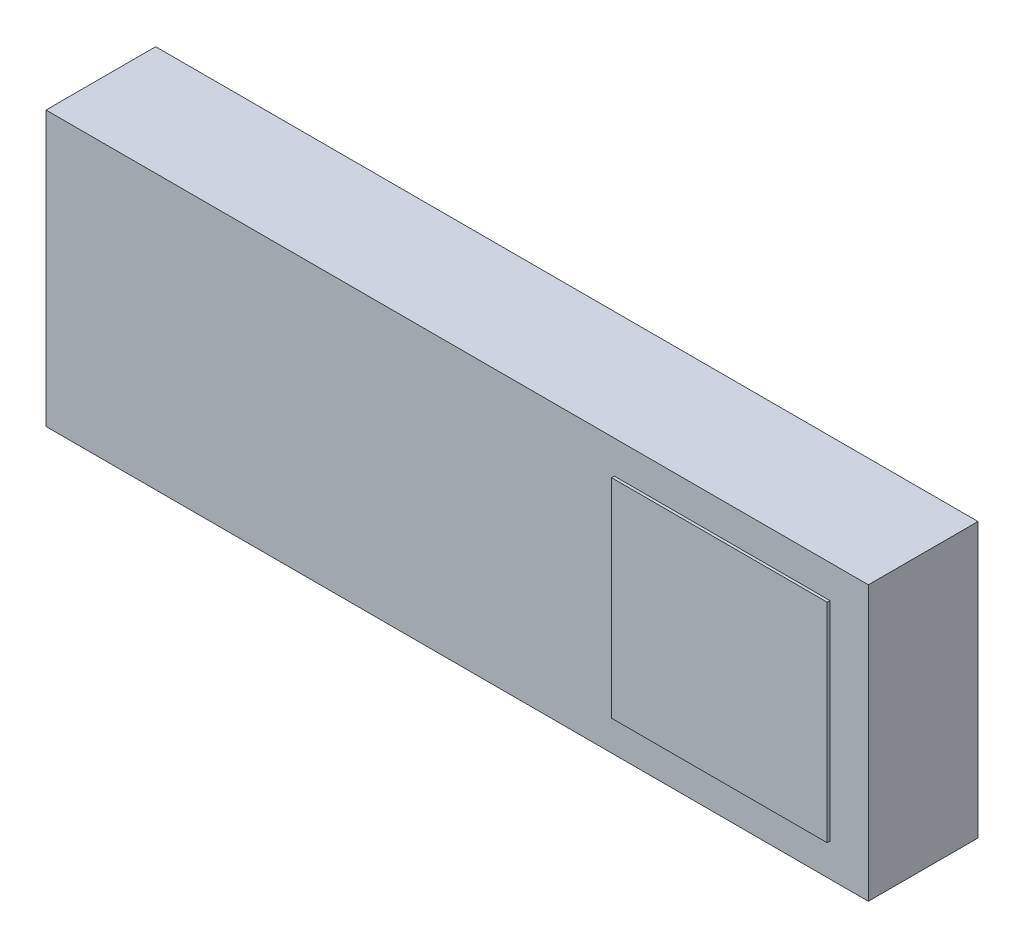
ISO-10303-21;
HEADER;
FILE_DESCRIPTION(('STEP AP214'),'2;1');
FILE_NAME('part.step','',(''),(''),'','','');
FILE_SCHEMA(('AUTOMOTIVE_DESIGN { 1 0 10303 214 1 1 1 1 }'));
ENDSEC;
DATA;
#1=APPLICATION_CONTEXT('core data for automotive mechanical design processes');
#2=APPLICATION_PROTOCOL_DEFINITION('international standard','automotive_design',2000,#1);
#3=PRODUCT_CONTEXT('',#1,'mechanical');
#4=PRODUCT('Part','Part','',(#3));
#5=PRODUCT_RELATED_PRODUCT_CATEGORY('part','',(#4));
#6=PRODUCT_DEFINITION_FORMATION('','',#4);
#7=PRODUCT_DEFINITION_CONTEXT('part definition',#1,'design');
#8=PRODUCT_DEFINITION('design','',#6,#7);
#9=PRODUCT_DEFINITION_SHAPE('','',#8);
#10=(LENGTH_UNIT() NAMED_UNIT(*) SI_UNIT(.MILLI.,.METRE.));
#11=(NAMED_UNIT(*) PLANE_ANGLE_UNIT() SI_UNIT($,.RADIAN.));
#12=(NAMED_UNIT(*) SI_UNIT($,.STERADIAN.) SOLID_ANGLE_UNIT());
#13=UNCERTAINTY_MEASURE_WITH_UNIT(LENGTH_MEASURE(1.E-05),#10,'distance_accuracy_value','');
#14=(GEOMETRIC_REPRESENTATION_CONTEXT(3) GLOBAL_UNCERTAINTY_ASSIGNED_CONTEXT((#13)) GLOBAL_UNIT_ASSIGNED_CONTEXT((#10,
#11,#12)) REPRESENTATION_CONTEXT('',''));
#15=CARTESIAN_POINT('',(0.,0.,0.));
#16=DIRECTION('',(0.,0.,1.));
#17=DIRECTION('',(1.,0.,0.));
#18=AXIS2_PLACEMENT_3D('',#15,#16,#17);
#19=CARTESIAN_POINT('',(-15.73850234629,-0.342490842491,0.41));
#20=DIRECTION('',(0.,0.,1.));
#21=DIRECTION('',(1.,0.,0.));
#22=AXIS2_PLACEMENT_3D('',#19,#20,#21);
#23=PLANE('',#22);
#24=DIRECTION('',(0.,1.,0.));
#25=VECTOR('',#24,1.);
#26=CARTESIAN_POINT('',(-16.13181907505,-0.722474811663,0.41));
#27=LINE('',#26,#25);
#28=CARTESIAN_POINT('',(-16.13181907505,-0.722474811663,0.41));
#29=VERTEX_POINT('',#28);
#30=CARTESIAN_POINT('',(-16.13181907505,0.03749312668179,0.41));
#31=VERTEX_POINT('',#30);
#32=EDGE_CURVE('E95',#29,#31,#27,.T.);
#33=ORIENTED_EDGE('',*,*,#32,.F.);
#34=DIRECTION('',(1.,0.,0.));
#35=VECTOR('',#34,1.);
#36=CARTESIAN_POINT('',(-15.34518561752,-0.722474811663,0.41));
#37=LINE('',#36,#35);
#38=CARTESIAN_POINT('',(-15.34518561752,-0.722474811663,0.41));
#39=VERTEX_POINT('',#38);
#40=EDGE_CURVE('E79',#39,#29,#37,.F.);
#41=ORIENTED_EDGE('',*,*,#40,.F.);
#42=DIRECTION('',(0.,1.,0.));
#43=VECTOR('',#42,1.);
#44=CARTESIAN_POINT('',(-15.34518561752,0.03749312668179,0.41));
#45=LINE('',#44,#43);
#46=CARTESIAN_POINT('',(-15.34518561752,0.03749312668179,0.41));
#47=VERTEX_POINT('',#46);
#48=EDGE_CURVE('E20',#47,#39,#45,.F.);
#49=ORIENTED_EDGE('',*,*,#48,.F.);
#50=DIRECTION('',(1.,0.,0.));
#51=VECTOR('',#50,1.);
#52=CARTESIAN_POINT('',(-16.13181907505,0.03749312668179,0.41));
#53=LINE('',#52,#51);
#54=EDGE_CURVE('E102',#31,#47,#53,.T.);
#55=ORIENTED_EDGE('',*,*,#54,.F.);
#56=EDGE_LOOP('',(#33,#41,#49,#55));
#57=FACE_BOUND('',#56,.T.);
#58=ADVANCED_FACE('F17',(#57),#23,.T.);
#59=CARTESIAN_POINT('',(-15.34518561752,0.03749312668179,0.4));
#60=DIRECTION('',(1.,0.,0.));
#61=DIRECTION('',(0.,0.,-1.));
#62=AXIS2_PLACEMENT_3D('',#59,#60,#61);
#63=PLANE('',#62);
#64=DIRECTION('',(0.,1.,0.));
#65=VECTOR('',#64,1.);
#66=CARTESIAN_POINT('',(-15.34518561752,-0.342490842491,0.4));
#67=LINE('',#66,#65);
#68=CARTESIAN_POINT('',(-15.34518561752,0.03749312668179,0.4));
#69=VERTEX_POINT('',#68);
#70=CARTESIAN_POINT('',(-15.34518561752,-0.722474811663,0.4));
#71=VERTEX_POINT('',#70);
#72=EDGE_CURVE('E108',#69,#71,#67,.F.);
#73=ORIENTED_EDGE('',*,*,#72,.F.);
#74=DIRECTION('',(0.,0.,1.));
#75=VECTOR('',#74,1.);
#76=CARTESIAN_POINT('',(-15.34518561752,0.03749312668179,0.4));
#77=LINE('',#76,#75);
#78=EDGE_CURVE('E90',#47,#69,#77,.F.);
#79=ORIENTED_EDGE('',*,*,#78,.F.);
#80=ORIENTED_EDGE('',*,*,#48,.T.);
#81=DIRECTION('',(0.,0.,-1.));
#82=VECTOR('',#81,1.);
#83=CARTESIAN_POINT('',(-15.34518561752,-0.722474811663,0.4));
#84=LINE('',#83,#82);
#85=EDGE_CURVE('E88',#71,#39,#84,.F.);
#86=ORIENTED_EDGE('',*,*,#85,.F.);
#87=EDGE_LOOP('',(#73,#79,#80,#86));
#88=FACE_BOUND('',#87,.T.);
#89=ADVANCED_FACE('F87',(#88),#63,.T.);
#90=CARTESIAN_POINT('',(-15.34518561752,-0.722474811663,0.4));
#91=DIRECTION('',(0.,-1.,0.));
#92=DIRECTION('',(0.,0.,-1.));
#93=AXIS2_PLACEMENT_3D('',#90,#91,#92);
#94=PLANE('',#93);
#95=DIRECTION('',(1.,0.,0.));
#96=VECTOR('',#95,1.);
#97=CARTESIAN_POINT('',(-16.70512820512,-0.722474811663,0.4));
#98=LINE('',#97,#96);
#99=CARTESIAN_POINT('',(-16.13181907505,-0.722474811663,0.4));
#100=VERTEX_POINT('',#99);
#101=EDGE_CURVE('E94',#71,#100,#98,.F.);
#102=ORIENTED_EDGE('',*,*,#101,.F.);
#103=ORIENTED_EDGE('',*,*,#85,.T.);
#104=ORIENTED_EDGE('',*,*,#40,.T.);
#105=DIRECTION('',(0.,0.,1.));
#106=VECTOR('',#105,1.);
#107=CARTESIAN_POINT('',(-16.13181907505,-0.722474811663,0.4));
#108=LINE('',#107,#106);
#109=EDGE_CURVE('E100',#100,#29,#108,.T.);
#110=ORIENTED_EDGE('',*,*,#109,.F.);
#111=EDGE_LOOP('',(#102,#103,#104,#110));
#112=FACE_BOUND('',#111,.T.);
#113=ADVANCED_FACE('F93',(#112),#94,.T.);
#114=CARTESIAN_POINT('',(-16.13181907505,-0.722474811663,0.4));
#115=DIRECTION('',(-1.,0.,0.));
#116=DIRECTION('',(0.,0.,1.));
#117=AXIS2_PLACEMENT_3D('',#114,#115,#116);
#118=PLANE('',#117);
#119=DIRECTION('',(0.,1.,0.));
#120=VECTOR('',#119,1.);
#121=CARTESIAN_POINT('',(-16.13181907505,-0.342490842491,0.4));
#122=LINE('',#121,#120);
#123=CARTESIAN_POINT('',(-16.13181907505,0.03749312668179,0.4));
#124=VERTEX_POINT('',#123);
#125=EDGE_CURVE('E111',#100,#124,#122,.T.);
#126=ORIENTED_EDGE('',*,*,#125,.F.);
#127=ORIENTED_EDGE('',*,*,#109,.T.);
#128=ORIENTED_EDGE('',*,*,#32,.T.);
#129=DIRECTION('',(0.,0.,1.));
#130=VECTOR('',#129,1.);
#131=CARTESIAN_POINT('',(-16.13181907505,0.03749312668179,0.4));
#132=LINE('',#131,#130);
#133=EDGE_CURVE('E105',#124,#31,#132,.T.);
#134=ORIENTED_EDGE('',*,*,#133,.F.);
#135=EDGE_LOOP('',(#126,#127,#128,#134));
#136=FACE_BOUND('',#135,.T.);
#137=ADVANCED_FACE('F177',(#136),#118,.T.);
#138=CARTESIAN_POINT('',(-16.13181907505,0.03749312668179,0.4));
#139=DIRECTION('',(0.,1.,0.));
#140=DIRECTION('',(0.,0.,1.));
#141=AXIS2_PLACEMENT_3D('',#138,#139,#140);
#142=PLANE('',#141);
#143=DIRECTION('',(1.,0.,0.));
#144=VECTOR('',#143,1.);
#145=CARTESIAN_POINT('',(-16.70512820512,0.03749312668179,0.4));
#146=LINE('',#145,#144);
#147=EDGE_CURVE('E113',#124,#69,#146,.T.);
#148=ORIENTED_EDGE('',*,*,#147,.F.);
#149=ORIENTED_EDGE('',*,*,#133,.T.);
#150=ORIENTED_EDGE('',*,*,#54,.T.);
#151=ORIENTED_EDGE('',*,*,#78,.T.);
#152=EDGE_LOOP('',(#148,#149,#150,#151));
#153=FACE_BOUND('',#152,.T.);
#154=ADVANCED_FACE('F173',(#153),#142,.T.);
#155=CARTESIAN_POINT('',(-16.70512820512,-0.342490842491,0.4));
#156=DIRECTION('',(0.,0.,1.));
#157=DIRECTION('',(1.,0.,0.));
#158=AXIS2_PLACEMENT_3D('',#155,#156,#157);
#159=PLANE('',#158);
#160=ORIENTED_EDGE('',*,*,#125,.T.);
#161=ORIENTED_EDGE('',*,*,#147,.T.);
#162=ORIENTED_EDGE('',*,*,#72,.T.);
#163=ORIENTED_EDGE('',*,*,#101,.T.);
#164=EDGE_LOOP('',(#160,#161,#162,#163));
#165=FACE_BOUND('',#164,.T.);
#166=DIRECTION('',(0.,1.,0.));
#167=VECTOR('',#166,1.);
#168=CARTESIAN_POINT('',(-15.20512820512,0.157509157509,0.4));
#169=LINE('',#168,#167);
#170=CARTESIAN_POINT('',(-15.20512820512,0.157509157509,0.4));
#171=VERTEX_POINT('',#170);
#172=CARTESIAN_POINT('',(-15.20512820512,-0.842490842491,0.4));
#173=VERTEX_POINT('',#172);
#174=EDGE_CURVE('E116',#171,#173,#169,.F.);
#175=ORIENTED_EDGE('',*,*,#174,.F.);
#176=DIRECTION('',(1.,0.,0.));
#177=VECTOR('',#176,1.);
#178=CARTESIAN_POINT('',(-18.20512820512,0.157509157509,0.4));
#179=LINE('',#178,#177);
#180=CARTESIAN_POINT('',(-18.20512820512,0.157509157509,0.4));
#181=VERTEX_POINT('',#180);
#182=EDGE_CURVE('E118',#181,#171,#179,.T.);
#183=ORIENTED_EDGE('',*,*,#182,.F.);
#184=DIRECTION('',(0.,1.,0.));
#185=VECTOR('',#184,1.);
#186=CARTESIAN_POINT('',(-18.20512820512,-0.842490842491,0.4));
#187=LINE('',#186,#185);
#188=CARTESIAN_POINT('',(-18.20512820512,-0.842490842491,0.4));
#189=VERTEX_POINT('',#188);
#190=EDGE_CURVE('E122',#189,#181,#187,.T.);
#191=ORIENTED_EDGE('',*,*,#190,.F.);
#192=DIRECTION('',(1.,0.,0.));
#193=VECTOR('',#192,1.);
#194=CARTESIAN_POINT('',(-15.20512820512,-0.842490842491,0.4));
#195=LINE('',#194,#193);
#196=EDGE_CURVE('E126',#173,#189,#195,.F.);
#197=ORIENTED_EDGE('',*,*,#196,.F.);
#198=EDGE_LOOP('',(#175,#183,#191,#197));
#199=FACE_BOUND('',#198,.T.);
#200=ADVANCED_FACE('F170',(#165,#199),#159,.T.);
#201=CARTESIAN_POINT('',(-15.20512820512,0.157509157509,0.));
#202=DIRECTION('',(1.,0.,0.));
#203=DIRECTION('',(0.,0.,-1.));
#204=AXIS2_PLACEMENT_3D('',#201,#202,#203);
#205=PLANE('',#204);
#206=DIRECTION('',(0.,1.,0.));
#207=VECTOR('',#206,1.);
#208=CARTESIAN_POINT('',(-15.20512820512,-0.342490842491,0.));
#209=LINE('',#208,#207);
#210=CARTESIAN_POINT('',(-15.20512820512,-0.842490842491,0.));
#211=VERTEX_POINT('',#210);
#212=CARTESIAN_POINT('',(-15.20512820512,0.157509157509,0.));
#213=VERTEX_POINT('',#212);
#214=EDGE_CURVE('E132',#211,#213,#209,.T.);
#215=ORIENTED_EDGE('',*,*,#214,.T.);
#216=DIRECTION('',(0.,0.,1.));
#217=VECTOR('',#216,1.);
#218=CARTESIAN_POINT('',(-15.20512820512,0.157509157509,0.));
#219=LINE('',#218,#217);
#220=EDGE_CURVE('E120',#171,#213,#219,.F.);
#221=ORIENTED_EDGE('',*,*,#220,.F.);
#222=ORIENTED_EDGE('',*,*,#174,.T.);
#223=DIRECTION('',(0.,0.,-1.));
#224=VECTOR('',#223,1.);
#225=CARTESIAN_POINT('',(-15.20512820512,-0.842490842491,0.));
#226=LINE('',#225,#224);
#227=EDGE_CURVE('E129',#211,#173,#226,.F.);
#228=ORIENTED_EDGE('',*,*,#227,.F.);
#229=EDGE_LOOP('',(#215,#221,#222,#228));
#230=FACE_BOUND('',#229,.T.);
#231=ADVANCED_FACE('F152',(#230),#205,.T.);
#232=CARTESIAN_POINT('',(-18.20512820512,0.157509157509,0.));
#233=DIRECTION('',(0.,1.,0.));
#234=DIRECTION('',(0.,0.,1.));
#235=AXIS2_PLACEMENT_3D('',#232,#233,#234);
#236=PLANE('',#235);
#237=DIRECTION('',(1.,0.,0.));
#238=VECTOR('',#237,1.);
#239=CARTESIAN_POINT('',(-16.70512820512,0.157509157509,0.));
#240=LINE('',#239,#238);
#241=CARTESIAN_POINT('',(-18.20512820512,0.157509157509,0.));
#242=VERTEX_POINT('',#241);
#243=EDGE_CURVE('E135',#213,#242,#240,.F.);
#244=ORIENTED_EDGE('',*,*,#243,.T.);
#245=DIRECTION('',(0.,0.,1.));
#246=VECTOR('',#245,1.);
#247=CARTESIAN_POINT('',(-18.20512820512,0.157509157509,0.));
#248=LINE('',#247,#246);
#249=EDGE_CURVE('E124',#181,#242,#248,.F.);
#250=ORIENTED_EDGE('',*,*,#249,.F.);
#251=ORIENTED_EDGE('',*,*,#182,.T.);
#252=ORIENTED_EDGE('',*,*,#220,.T.);
#253=EDGE_LOOP('',(#244,#250,#251,#252));
#254=FACE_BOUND('',#253,.T.);
#255=ADVANCED_FACE('F147',(#254),#236,.T.);
#256=CARTESIAN_POINT('',(-18.20512820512,-0.842490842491,0.));
#257=DIRECTION('',(-1.,0.,0.));
#258=DIRECTION('',(0.,0.,1.));
#259=AXIS2_PLACEMENT_3D('',#256,#257,#258);
#260=PLANE('',#259);
#261=DIRECTION('',(0.,1.,0.));
#262=VECTOR('',#261,1.);
#263=CARTESIAN_POINT('',(-18.20512820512,-0.342490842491,0.));
#264=LINE('',#263,#262);
#265=CARTESIAN_POINT('',(-18.20512820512,-0.842490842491,0.));
#266=VERTEX_POINT('',#265);
#267=EDGE_CURVE('E26',#242,#266,#264,.F.);
#268=ORIENTED_EDGE('',*,*,#267,.T.);
#269=DIRECTION('',(0.,0.,-1.));
#270=VECTOR('',#269,1.);
#271=CARTESIAN_POINT('',(-18.20512820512,-0.842490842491,0.));
#272=LINE('',#271,#270);
#273=EDGE_CURVE('E34',#189,#266,#272,.T.);
#274=ORIENTED_EDGE('',*,*,#273,.F.);
#275=ORIENTED_EDGE('',*,*,#190,.T.);
#276=ORIENTED_EDGE('',*,*,#249,.T.);
#277=EDGE_LOOP('',(#268,#274,#275,#276));
#278=FACE_BOUND('',#277,.T.);
#279=ADVANCED_FACE('F141',(#278),#260,.T.);
#280=CARTESIAN_POINT('',(-15.20512820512,-0.842490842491,0.));
#281=DIRECTION('',(0.,-1.,0.));
#282=DIRECTION('',(0.,0.,-1.));
#283=AXIS2_PLACEMENT_3D('',#280,#281,#282);
#284=PLANE('',#283);
#285=DIRECTION('',(1.,0.,0.));
#286=VECTOR('',#285,1.);
#287=CARTESIAN_POINT('',(-16.70512820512,-0.842490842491,0.));
#288=LINE('',#287,#286);
#289=EDGE_CURVE('E11',#266,#211,#288,.T.);
#290=ORIENTED_EDGE('',*,*,#289,.T.);
#291=ORIENTED_EDGE('',*,*,#227,.T.);
#292=ORIENTED_EDGE('',*,*,#196,.T.);
#293=ORIENTED_EDGE('',*,*,#273,.T.);
#294=EDGE_LOOP('',(#290,#291,#292,#293));
#295=FACE_BOUND('',#294,.T.);
#296=ADVANCED_FACE('F155',(#295),#284,.T.);
#297=CARTESIAN_POINT('',(-16.70512820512,-0.342490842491,0.));
#298=DIRECTION('',(0.,0.,1.));
#299=DIRECTION('',(1.,0.,0.));
#300=AXIS2_PLACEMENT_3D('',#297,#298,#299);
#301=PLANE('',#300);
#302=ORIENTED_EDGE('',*,*,#267,.F.);
#303=ORIENTED_EDGE('',*,*,#243,.F.);
#304=ORIENTED_EDGE('',*,*,#214,.F.);
#305=ORIENTED_EDGE('',*,*,#289,.F.);
#306=EDGE_LOOP('',(#302,#303,#304,#305));
#307=FACE_BOUND('',#306,.T.);
#308=ADVANCED_FACE('F145',(#307),#301,.F.);
#309=CLOSED_SHELL('',(#58,#89,#113,#137,#154,#200,#231,#255,#279,#296,#308));
#310=MANIFOLD_SOLID_BREP('B1',#309);
#311=ADVANCED_BREP_SHAPE_REPRESENTATION('',(#18,#310),#14);
#312=SHAPE_DEFINITION_REPRESENTATION(#9,#311);
ENDSEC;
END-ISO-10303-21;
